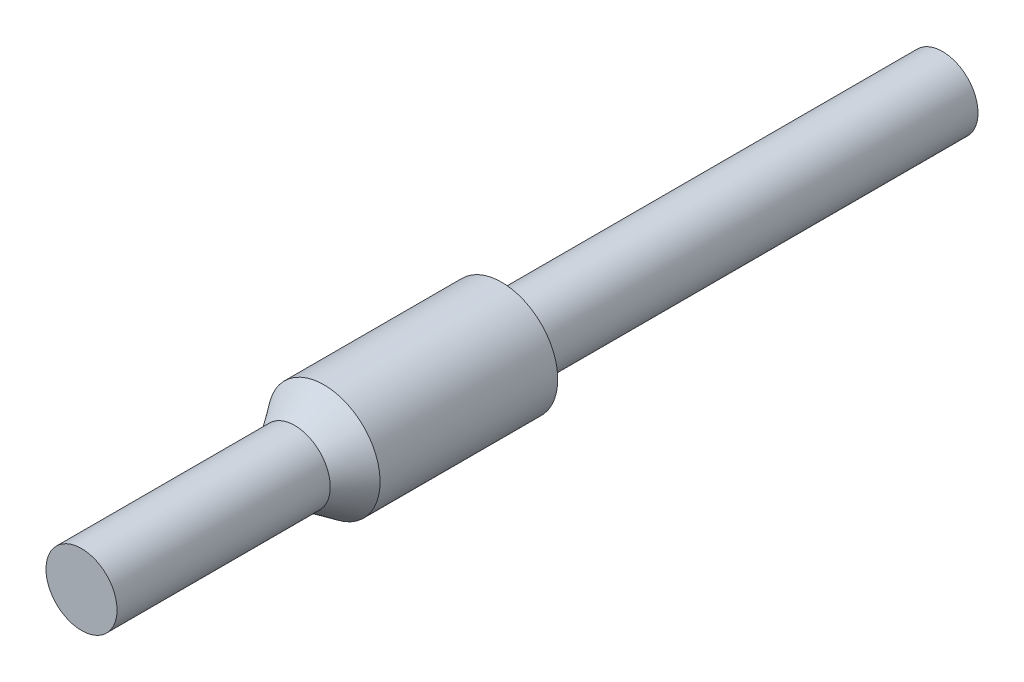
ISO-10303-21;
HEADER;
FILE_DESCRIPTION(('STEP AP214'),'2;1');
FILE_NAME('part.step','',(''),(''),'','','');
FILE_SCHEMA(('AUTOMOTIVE_DESIGN { 1 0 10303 214 1 1 1 1 }'));
ENDSEC;
DATA;
#1=APPLICATION_CONTEXT('core data for automotive mechanical design processes');
#2=APPLICATION_PROTOCOL_DEFINITION('international standard','automotive_design',2000,#1);
#3=PRODUCT_CONTEXT('',#1,'mechanical');
#4=PRODUCT('Part','Part','',(#3));
#5=PRODUCT_RELATED_PRODUCT_CATEGORY('part','',(#4));
#6=PRODUCT_DEFINITION_FORMATION('','',#4);
#7=PRODUCT_DEFINITION_CONTEXT('part definition',#1,'design');
#8=PRODUCT_DEFINITION('design','',#6,#7);
#9=PRODUCT_DEFINITION_SHAPE('','',#8);
#10=(LENGTH_UNIT() NAMED_UNIT(*) SI_UNIT(.MILLI.,.METRE.));
#11=(NAMED_UNIT(*) PLANE_ANGLE_UNIT() SI_UNIT($,.RADIAN.));
#12=(NAMED_UNIT(*) SI_UNIT($,.STERADIAN.) SOLID_ANGLE_UNIT());
#13=UNCERTAINTY_MEASURE_WITH_UNIT(LENGTH_MEASURE(1.E-05),#10,'distance_accuracy_value','');
#14=(GEOMETRIC_REPRESENTATION_CONTEXT(3) GLOBAL_UNCERTAINTY_ASSIGNED_CONTEXT((#13)) GLOBAL_UNIT_ASSIGNED_CONTEXT((#10,
#11,#12)) REPRESENTATION_CONTEXT('',''));
#15=CARTESIAN_POINT('',(0.,0.,0.));
#16=DIRECTION('',(0.,0.,1.));
#17=DIRECTION('',(1.,0.,0.));
#18=AXIS2_PLACEMENT_3D('',#15,#16,#17);
#19=CARTESIAN_POINT('',(0.,0.,142.007005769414));
#20=DIRECTION('',(0.,0.,-1.));
#21=DIRECTION('',(0.,1.,0.));
#22=AXIS2_PLACEMENT_3D('',#19,#20,#21);
#23=PLANE('',#22);
#24=CARTESIAN_POINT('',(0.,0.,142.007005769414));
#25=DIRECTION('',(0.,0.,1.));
#26=DIRECTION('',(0.,-1.,0.));
#27=AXIS2_PLACEMENT_3D('',#24,#25,#26);
#28=CIRCLE('',#27,10.);
#29=CARTESIAN_POINT('',(0.,-10.,142.007005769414));
#30=VERTEX_POINT('',#29);
#31=EDGE_CURVE('E10',#30,#30,#28,.T.);
#32=ORIENTED_EDGE('',*,*,#31,.T.);
#33=EDGE_LOOP('',(#32));
#34=FACE_BOUND('',#33,.T.);
#35=ADVANCED_FACE('F28',(#34),#23,.F.);
#36=CARTESIAN_POINT('',(0.,0.,142.007005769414));
#37=DIRECTION('',(0.,0.,1.));
#38=DIRECTION('',(0.,-1.,0.));
#39=AXIS2_PLACEMENT_3D('',#36,#37,#38);
#40=CYLINDRICAL_SURFACE('',#39,10.);
#41=ORIENTED_EDGE('',*,*,#31,.F.);
#42=EDGE_LOOP('',(#41));
#43=FACE_BOUND('',#42,.T.);
#44=CARTESIAN_POINT('',(0.,0.,82.0070057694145));
#45=DIRECTION('',(0.,0.,1.));
#46=DIRECTION('',(0.,-1.,0.));
#47=AXIS2_PLACEMENT_3D('',#44,#45,#46);
#48=CIRCLE('',#47,10.);
#49=CARTESIAN_POINT('',(0.,-10.,82.0070057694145));
#50=VERTEX_POINT('',#49);
#51=EDGE_CURVE('E34',#50,#50,#48,.T.);
#52=ORIENTED_EDGE('',*,*,#51,.T.);
#53=EDGE_LOOP('',(#52));
#54=FACE_BOUND('',#53,.T.);
#55=ADVANCED_FACE('F66',(#43,#54),#40,.T.);
#56=CARTESIAN_POINT('',(0.,0.,73.7549415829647));
#57=DIRECTION('',(0.,0.,-1.));
#58=DIRECTION('',(0.,1.,0.));
#59=AXIS2_PLACEMENT_3D('',#56,#57,#58);
#60=CONICAL_SURFACE('',#59,15.7781575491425,0.610865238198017);
#61=ORIENTED_EDGE('',*,*,#51,.F.);
#62=EDGE_LOOP('',(#61));
#63=FACE_BOUND('',#62,.T.);
#64=CARTESIAN_POINT('',(0.,0.,73.7549415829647));
#65=DIRECTION('',(0.,0.,1.));
#66=DIRECTION('',(0.,-1.,0.));
#67=AXIS2_PLACEMENT_3D('',#64,#65,#66);
#68=CIRCLE('',#67,15.7781575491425);
#69=CARTESIAN_POINT('',(0.,-15.7781575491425,73.7549415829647));
#70=VERTEX_POINT('',#69);
#71=EDGE_CURVE('E38',#70,#70,#68,.T.);
#72=ORIENTED_EDGE('',*,*,#71,.T.);
#73=EDGE_LOOP('',(#72));
#74=FACE_BOUND('',#73,.T.);
#75=ADVANCED_FACE('F70',(#63,#74),#60,.T.);
#76=CARTESIAN_POINT('',(0.,0.,142.007005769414));
#77=DIRECTION('',(0.,0.,1.));
#78=DIRECTION('',(0.,-1.,0.));
#79=AXIS2_PLACEMENT_3D('',#76,#77,#78);
#80=CYLINDRICAL_SURFACE('',#79,15.7781575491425);
#81=ORIENTED_EDGE('',*,*,#71,.F.);
#82=EDGE_LOOP('',(#81));
#83=FACE_BOUND('',#82,.T.);
#84=CARTESIAN_POINT('',(0.,0.,23.7549415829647));
#85=DIRECTION('',(0.,0.,1.));
#86=DIRECTION('',(0.,-1.,0.));
#87=AXIS2_PLACEMENT_3D('',#84,#85,#86);
#88=CIRCLE('',#87,15.7781575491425);
#89=CARTESIAN_POINT('',(0.,-15.7781575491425,23.7549415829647));
#90=VERTEX_POINT('',#89);
#91=EDGE_CURVE('E42',#90,#90,#88,.T.);
#92=ORIENTED_EDGE('',*,*,#91,.T.);
#93=EDGE_LOOP('',(#92));
#94=FACE_BOUND('',#93,.T.);
#95=ADVANCED_FACE('F75',(#83,#94),#80,.T.);
#96=CARTESIAN_POINT('',(0.,0.,19.7090321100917));
#97=DIRECTION('',(0.,0.,1.));
#98=DIRECTION('',(0.,-1.,0.));
#99=AXIS2_PLACEMENT_3D('',#96,#97,#98);
#100=CONICAL_SURFACE('',#99,10.,0.959931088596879);
#101=ORIENTED_EDGE('',*,*,#91,.F.);
#102=EDGE_LOOP('',(#101));
#103=FACE_BOUND('',#102,.T.);
#104=CARTESIAN_POINT('',(0.,0.,19.7090321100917));
#105=DIRECTION('',(0.,0.,1.));
#106=DIRECTION('',(0.,-1.,0.));
#107=AXIS2_PLACEMENT_3D('',#104,#105,#106);
#108=CIRCLE('',#107,10.);
#109=CARTESIAN_POINT('',(0.,-10.,19.7090321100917));
#110=VERTEX_POINT('',#109);
#111=EDGE_CURVE('E47',#110,#110,#108,.T.);
#112=ORIENTED_EDGE('',*,*,#111,.T.);
#113=EDGE_LOOP('',(#112));
#114=FACE_BOUND('',#113,.T.);
#115=ADVANCED_FACE('F62',(#103,#114),#100,.T.);
#116=CARTESIAN_POINT('',(0.,0.,142.007005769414));
#117=DIRECTION('',(0.,0.,1.));
#118=DIRECTION('',(0.,-1.,0.));
#119=AXIS2_PLACEMENT_3D('',#116,#117,#118);
#120=CYLINDRICAL_SURFACE('',#119,10.);
#121=ORIENTED_EDGE('',*,*,#111,.F.);
#122=EDGE_LOOP('',(#121));
#123=FACE_BOUND('',#122,.T.);
#124=CARTESIAN_POINT('',(0.,0.,-100.290967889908));
#125=DIRECTION('',(0.,0.,1.));
#126=DIRECTION('',(0.,-1.,0.));
#127=AXIS2_PLACEMENT_3D('',#124,#125,#126);
#128=CIRCLE('',#127,9.99999999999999);
#129=CARTESIAN_POINT('',(0.,-9.99999999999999,-100.290967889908));
#130=VERTEX_POINT('',#129);
#131=EDGE_CURVE('E50',#130,#130,#128,.T.);
#132=ORIENTED_EDGE('',*,*,#131,.T.);
#133=EDGE_LOOP('',(#132));
#134=FACE_BOUND('',#133,.T.);
#135=ADVANCED_FACE('F54',(#123,#134),#120,.T.);
#136=CARTESIAN_POINT('',(0.,9.99999999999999,-100.290967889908));
#137=DIRECTION('',(0.,0.,1.));
#138=DIRECTION('',(0.,-1.,0.));
#139=AXIS2_PLACEMENT_3D('',#136,#137,#138);
#140=PLANE('',#139);
#141=ORIENTED_EDGE('',*,*,#131,.F.);
#142=EDGE_LOOP('',(#141));
#143=FACE_BOUND('',#142,.T.);
#144=ADVANCED_FACE('F56',(#143),#140,.F.);
#145=CLOSED_SHELL('',(#35,#55,#75,#95,#115,#135,#144));
#146=MANIFOLD_SOLID_BREP('B2',#145);
#147=ADVANCED_BREP_SHAPE_REPRESENTATION('',(#18,#146),#14);
#148=SHAPE_DEFINITION_REPRESENTATION(#9,#147);
ENDSEC;
END-ISO-10303-21;
